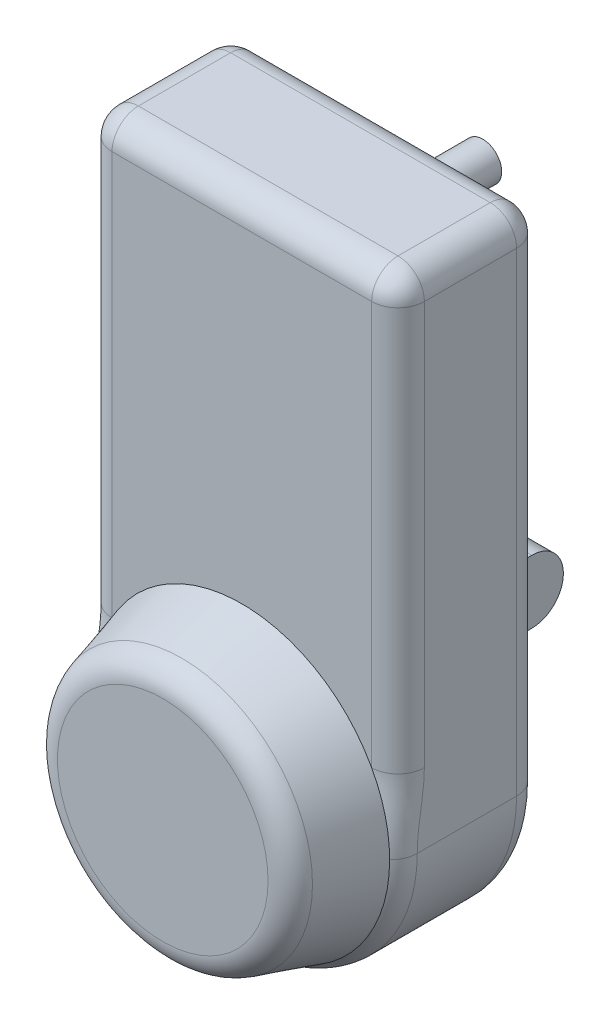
ISO-10303-21;
HEADER;
FILE_DESCRIPTION(('STEP AP214'),'2;1');
FILE_NAME('part.step','',(''),(''),'','','');
FILE_SCHEMA(('AUTOMOTIVE_DESIGN { 1 0 10303 214 1 1 1 1 }'));
ENDSEC;
DATA;
#1=APPLICATION_CONTEXT('core data for automotive mechanical design processes');
#2=APPLICATION_PROTOCOL_DEFINITION('international standard','automotive_design',2000,#1);
#3=PRODUCT_CONTEXT('',#1,'mechanical');
#4=PRODUCT('Part','Part','',(#3));
#5=PRODUCT_RELATED_PRODUCT_CATEGORY('part','',(#4));
#6=PRODUCT_DEFINITION_FORMATION('','',#4);
#7=PRODUCT_DEFINITION_CONTEXT('part definition',#1,'design');
#8=PRODUCT_DEFINITION('design','',#6,#7);
#9=PRODUCT_DEFINITION_SHAPE('','',#8);
#10=(LENGTH_UNIT() NAMED_UNIT(*) SI_UNIT(.MILLI.,.METRE.));
#11=(NAMED_UNIT(*) PLANE_ANGLE_UNIT() SI_UNIT($,.RADIAN.));
#12=(NAMED_UNIT(*) SI_UNIT($,.STERADIAN.) SOLID_ANGLE_UNIT());
#13=UNCERTAINTY_MEASURE_WITH_UNIT(LENGTH_MEASURE(1.E-05),#10,'distance_accuracy_value','');
#14=(GEOMETRIC_REPRESENTATION_CONTEXT(3) GLOBAL_UNCERTAINTY_ASSIGNED_CONTEXT((#13)) GLOBAL_UNIT_ASSIGNED_CONTEXT((#10,
#11,#12)) REPRESENTATION_CONTEXT('',''));
#15=CARTESIAN_POINT('',(0.,0.,0.));
#16=DIRECTION('',(0.,0.,1.));
#17=DIRECTION('',(1.,0.,0.));
#18=AXIS2_PLACEMENT_3D('',#15,#16,#17);
#19=CARTESIAN_POINT('',(0.,0.,0.));
#20=DIRECTION('',(0.,0.,1.));
#21=DIRECTION('',(1.,0.,0.));
#22=AXIS2_PLACEMENT_3D('',#19,#20,#21);
#23=PLANE('',#22);
#24=CARTESIAN_POINT('',(1.62968175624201,41.2166885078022,0.));
#25=DIRECTION('',(0.,0.,1.));
#26=DIRECTION('',(1.,0.,0.));
#27=AXIS2_PLACEMENT_3D('',#24,#25,#26);
#28=CIRCLE('',#27,1.82371156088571);
#29=CARTESIAN_POINT('',(3.45339331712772,41.2166885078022,0.));
#30=VERTEX_POINT('',#29);
#31=EDGE_CURVE('E11',#30,#30,#28,.F.);
#32=ORIENTED_EDGE('',*,*,#31,.F.);
#33=EDGE_LOOP('',(#32));
#34=FACE_BOUND('',#33,.T.);
#35=DIRECTION('',(-1.,0.,0.));
#36=VECTOR('',#35,1.);
#37=CARTESIAN_POINT('',(0.,45.72,0.));
#38=LINE('',#37,#36);
#39=CARTESIAN_POINT('',(-12.5095,45.72,0.));
#40=VERTEX_POINT('',#39);
#41=CARTESIAN_POINT('',(12.5095,45.72,0.));
#42=VERTEX_POINT('',#41);
#43=EDGE_CURVE('E53',#40,#42,#38,.F.);
#44=ORIENTED_EDGE('',*,*,#43,.T.);
#45=DIRECTION('',(0.,1.,0.));
#46=VECTOR('',#45,1.);
#47=CARTESIAN_POINT('',(12.5095,0.,0.));
#48=LINE('',#47,#46);
#49=CARTESIAN_POINT('',(12.5095,0.,0.));
#50=VERTEX_POINT('',#49);
#51=EDGE_CURVE('E38',#42,#50,#48,.F.);
#52=ORIENTED_EDGE('',*,*,#51,.T.);
#53=CARTESIAN_POINT('',(0.,0.,0.));
#54=DIRECTION('',(0.,0.,1.));
#55=DIRECTION('',(1.,0.,0.));
#56=AXIS2_PLACEMENT_3D('',#53,#54,#55);
#57=CIRCLE('',#56,12.5095);
#58=CARTESIAN_POINT('',(-12.5095,0.,0.));
#59=VERTEX_POINT('',#58);
#60=EDGE_CURVE('E436',#50,#59,#57,.F.);
#61=ORIENTED_EDGE('',*,*,#60,.T.);
#62=DIRECTION('',(0.,-1.,0.));
#63=VECTOR('',#62,1.);
#64=CARTESIAN_POINT('',(-12.5095,0.,0.));
#65=LINE('',#64,#63);
#66=EDGE_CURVE('E438',#59,#40,#65,.F.);
#67=ORIENTED_EDGE('',*,*,#66,.T.);
#68=EDGE_LOOP('',(#44,#52,#61,#67));
#69=FACE_BOUND('',#68,.T.);
#70=DIRECTION('',(0.,-1.,0.));
#71=VECTOR('',#70,1.);
#72=CARTESIAN_POINT('',(10.16,8.382,0.));
#73=LINE('',#72,#71);
#74=CARTESIAN_POINT('',(10.16,14.478,0.));
#75=VERTEX_POINT('',#74);
#76=CARTESIAN_POINT('',(10.16,8.382,0.));
#77=VERTEX_POINT('',#76);
#78=EDGE_CURVE('E175',#75,#77,#73,.T.);
#79=ORIENTED_EDGE('',*,*,#78,.F.);
#80=DIRECTION('',(-1.,0.,0.));
#81=VECTOR('',#80,1.);
#82=CARTESIAN_POINT('',(10.16,14.478,0.));
#83=LINE('',#82,#81);
#84=CARTESIAN_POINT('',(0.,14.478,0.));
#85=VERTEX_POINT('',#84);
#86=EDGE_CURVE('E178',#75,#85,#83,.T.);
#87=ORIENTED_EDGE('',*,*,#86,.T.);
#88=DIRECTION('',(0.,-1.,0.));
#89=VECTOR('',#88,1.);
#90=CARTESIAN_POINT('',(0.,8.382,0.));
#91=LINE('',#90,#89);
#92=CARTESIAN_POINT('',(0.,8.382,0.));
#93=VERTEX_POINT('',#92);
#94=EDGE_CURVE('E168',#85,#93,#91,.T.);
#95=ORIENTED_EDGE('',*,*,#94,.T.);
#96=DIRECTION('',(-1.,0.,0.));
#97=VECTOR('',#96,1.);
#98=CARTESIAN_POINT('',(10.16,8.382,0.));
#99=LINE('',#98,#97);
#100=EDGE_CURVE('E163',#77,#93,#99,.T.);
#101=ORIENTED_EDGE('',*,*,#100,.F.);
#102=EDGE_LOOP('',(#79,#87,#95,#101));
#103=FACE_BOUND('',#102,.T.);
#104=ADVANCED_FACE('F29',(#34,#69,#103),#23,.F.);
#105=CARTESIAN_POINT('',(0.,0.,13.97));
#106=DIRECTION('',(0.,0.,1.));
#107=DIRECTION('',(1.,0.,0.));
#108=AXIS2_PLACEMENT_3D('',#105,#106,#107);
#109=PLANE('',#108);
#110=CARTESIAN_POINT('',(0.,0.,13.97));
#111=DIRECTION('',(0.,0.,1.));
#112=DIRECTION('',(1.,0.,0.));
#113=AXIS2_PLACEMENT_3D('',#110,#111,#112);
#114=CIRCLE('',#113,14.2453327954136);
#115=CARTESIAN_POINT('',(12.5095,6.81483060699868,13.97));
#116=VERTEX_POINT('',#115);
#117=CARTESIAN_POINT('',(-12.5095,6.81483060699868,13.97));
#118=VERTEX_POINT('',#117);
#119=EDGE_CURVE('E476',#116,#118,#114,.T.);
#120=ORIENTED_EDGE('',*,*,#119,.F.);
#121=DIRECTION('',(0.,1.,0.));
#122=VECTOR('',#121,1.);
#123=CARTESIAN_POINT('',(12.5095,48.26,13.97));
#124=LINE('',#123,#122);
#125=CARTESIAN_POINT('',(12.5095,45.72,13.97));
#126=VERTEX_POINT('',#125);
#127=EDGE_CURVE('E389',#116,#126,#124,.T.);
#128=ORIENTED_EDGE('',*,*,#127,.T.);
#129=DIRECTION('',(-1.,0.,0.));
#130=VECTOR('',#129,1.);
#131=CARTESIAN_POINT('',(-15.0495,45.72,13.97));
#132=LINE('',#131,#130);
#133=CARTESIAN_POINT('',(-12.5095,45.72,13.97));
#134=VERTEX_POINT('',#133);
#135=EDGE_CURVE('E385',#126,#134,#132,.T.);
#136=ORIENTED_EDGE('',*,*,#135,.T.);
#137=DIRECTION('',(0.,-1.,0.));
#138=VECTOR('',#137,1.);
#139=CARTESIAN_POINT('',(-12.5095,0.,13.97));
#140=LINE('',#139,#138);
#141=EDGE_CURVE('E387',#134,#118,#140,.T.);
#142=ORIENTED_EDGE('',*,*,#141,.T.);
#143=EDGE_LOOP('',(#120,#128,#136,#142));
#144=FACE_BOUND('',#143,.T.);
#145=ADVANCED_FACE('F208',(#144),#109,.T.);
#146=CARTESIAN_POINT('',(0.,0.,13.97));
#147=DIRECTION('',(0.,0.,-1.));
#148=DIRECTION('',(-1.,0.,0.));
#149=AXIS2_PLACEMENT_3D('',#146,#147,#148);
#150=CYLINDRICAL_SURFACE('',#149,15.0495);
#151=DIRECTION('',(0.,0.,-1.));
#152=VECTOR('',#151,1.);
#153=CARTESIAN_POINT('',(15.0495,0.,13.97));
#154=LINE('',#153,#152);
#155=CARTESIAN_POINT('',(15.0495,0.,12.1156848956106));
#156=VERTEX_POINT('',#155);
#157=CARTESIAN_POINT('',(15.0495,0.,2.54));
#158=VERTEX_POINT('',#157);
#159=EDGE_CURVE('E368',#156,#158,#154,.T.);
#160=ORIENTED_EDGE('',*,*,#159,.F.);
#161=CARTESIAN_POINT('',(0.,0.,12.1156848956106));
#162=DIRECTION('',(0.,0.,1.));
#163=DIRECTION('',(1.,0.,0.));
#164=AXIS2_PLACEMENT_3D('',#161,#162,#163);
#165=CIRCLE('',#164,15.0495);
#166=CARTESIAN_POINT('',(-15.0495,0.,12.1156848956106));
#167=VERTEX_POINT('',#166);
#168=EDGE_CURVE('E355',#156,#167,#165,.F.);
#169=ORIENTED_EDGE('',*,*,#168,.T.);
#170=DIRECTION('',(0.,0.,-1.));
#171=VECTOR('',#170,1.);
#172=CARTESIAN_POINT('',(-15.0495,0.,13.97));
#173=LINE('',#172,#171);
#174=CARTESIAN_POINT('',(-15.0495,0.,2.54));
#175=VERTEX_POINT('',#174);
#176=EDGE_CURVE('E375',#167,#175,#173,.T.);
#177=ORIENTED_EDGE('',*,*,#176,.T.);
#178=CARTESIAN_POINT('',(0.,0.,2.54));
#179=DIRECTION('',(0.,0.,1.));
#180=DIRECTION('',(1.,0.,0.));
#181=AXIS2_PLACEMENT_3D('',#178,#179,#180);
#182=CIRCLE('',#181,15.0495);
#183=EDGE_CURVE('E363',#175,#158,#182,.T.);
#184=ORIENTED_EDGE('',*,*,#183,.T.);
#185=EDGE_LOOP('',(#160,#169,#177,#184));
#186=FACE_BOUND('',#185,.T.);
#187=ADVANCED_FACE('F303',(#186),#150,.T.);
#188=CARTESIAN_POINT('',(15.0495,0.,13.97));
#189=DIRECTION('',(-1.,0.,0.));
#190=DIRECTION('',(0.,0.,1.));
#191=AXIS2_PLACEMENT_3D('',#188,#189,#190);
#192=PLANE('',#191);
#193=DIRECTION('',(0.,1.,0.));
#194=VECTOR('',#193,1.);
#195=CARTESIAN_POINT('',(15.0495,0.,11.43));
#196=LINE('',#195,#194);
#197=CARTESIAN_POINT('',(15.0495,45.72,11.43));
#198=VERTEX_POINT('',#197);
#199=CARTESIAN_POINT('',(15.0495,6.81483060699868,11.43));
#200=VERTEX_POINT('',#199);
#201=EDGE_CURVE('E371',#198,#200,#196,.F.);
#202=ORIENTED_EDGE('',*,*,#201,.T.);
#203=CARTESIAN_POINT('',(15.0495,-1.50407576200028,12.0352771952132));
#204=CARTESIAN_POINT('',(15.0495,-1.62362806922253,13.212621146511));
#205=CARTESIAN_POINT('',(14.1434679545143,-1.70053540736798,13.97));
#206=CARTESIAN_POINT('',(15.0495,-1.36322886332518,12.0496054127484));
#207=CARTESIAN_POINT('',(15.0495,-1.47277249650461,13.2129147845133));
#208=CARTESIAN_POINT('',(14.1623521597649,-1.54356654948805,13.97));
#209=CARTESIAN_POINT('',(15.0495,-1.22220180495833,12.0622994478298));
#210=CARTESIAN_POINT('',(15.0495,-1.3209201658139,13.2134506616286));
#211=CARTESIAN_POINT('',(14.1787023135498,-1.38544232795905,13.97));
#212=CARTESIAN_POINT('',(15.0495,-0.939839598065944,12.0839338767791));
#213=CARTESIAN_POINT('',(15.0495,-1.01656522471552,13.2146436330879));
#214=CARTESIAN_POINT('',(14.2061752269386,-1.06746468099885,13.97));
#215=CARTESIAN_POINT('',(15.0495,-0.798504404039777,12.0928736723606));
#216=CARTESIAN_POINT('',(15.0495,-0.86387401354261,13.2153011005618));
#217=CARTESIAN_POINT('',(14.217297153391,-0.907610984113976,13.97));
#218=CARTESIAN_POINT('',(15.0495,-0.515941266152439,12.1064941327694));
#219=CARTESIAN_POINT('',(15.0495,-0.558491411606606,13.2163799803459));
#220=CARTESIAN_POINT('',(14.2341292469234,-0.587167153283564,13.97));
#221=CARTESIAN_POINT('',(15.0495,-0.374713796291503,12.1111843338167));
#222=CARTESIAN_POINT('',(15.0495,-0.405609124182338,13.2168030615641));
#223=CARTESIAN_POINT('',(14.2398515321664,-0.426579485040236,13.97));
#224=CARTESIAN_POINT('',(15.0495,-0.0921941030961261,12.1161122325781));
#225=CARTESIAN_POINT('',(15.0495,-0.0998602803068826,13.2172539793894));
#226=CARTESIAN_POINT('',(14.2458540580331,-0.105024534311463,13.97));
#227=CARTESIAN_POINT('',(15.0495,0.0490981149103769,12.1163502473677));
#228=CARTESIAN_POINT('',(15.0495,0.0532009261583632,13.2172824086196));
#229=CARTESIAN_POINT('',(14.2461346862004,0.0559427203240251,13.97));
#230=CARTESIAN_POINT('',(15.0495,0.472910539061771,12.1102897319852));
#231=CARTESIAN_POINT('',(15.0495,0.512017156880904,13.2167071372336));
#232=CARTESIAN_POINT('',(14.2387813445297,0.538393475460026,13.97));
#233=CARTESIAN_POINT('',(15.0495,0.755354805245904,12.0972160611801));
#234=CARTESIAN_POINT('',(15.0495,0.81830175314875,13.2154393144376));
#235=CARTESIAN_POINT('',(14.2229514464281,0.859412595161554,13.97));
#236=CARTESIAN_POINT('',(15.0495,1.31927561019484,12.055597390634));
#237=CARTESIAN_POINT('',(15.0495,1.42634911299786,13.213025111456));
#238=CARTESIAN_POINT('',(14.1702642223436,1.49501519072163,13.97));
#239=CARTESIAN_POINT('',(15.0495,1.60075096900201,12.0270376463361));
#240=CARTESIAN_POINT('',(15.0495,1.72961496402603,13.211873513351));
#241=CARTESIAN_POINT('',(14.133386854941,1.80959223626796,13.97));
#242=CARTESIAN_POINT('',(15.0495,2.1598426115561,11.9599434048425));
#243=CARTESIAN_POINT('',(15.0495,2.32688719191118,13.2136005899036));
#244=CARTESIAN_POINT('',(14.0407876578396,2.42525410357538,13.97));
#245=CARTESIAN_POINT('',(15.0495,2.43747068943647,11.9215021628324));
#246=CARTESIAN_POINT('',(15.0495,2.62235478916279,13.2164920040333));
#247=CARTESIAN_POINT('',(13.9852405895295,2.72643574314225,13.97));
#248=CARTESIAN_POINT('',(15.0495,2.99207126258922,11.8401743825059));
#249=CARTESIAN_POINT('',(15.0495,3.20575921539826,13.2309089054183));
#250=CARTESIAN_POINT('',(13.8573274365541,3.31586775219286,13.97));
#251=CARTESIAN_POINT('',(15.0495,3.26904369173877,11.7972874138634));
#252=CARTESIAN_POINT('',(15.0495,3.49494828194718,13.2426114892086));
#253=CARTESIAN_POINT('',(13.7849597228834,3.60411686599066,13.97));
#254=CARTESIAN_POINT('',(15.0495,3.82246823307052,11.7125948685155));
#255=CARTESIAN_POINT('',(15.0495,4.06354779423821,13.2796454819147));
#256=CARTESIAN_POINT('',(13.6258677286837,4.16534673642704,13.97));
#257=CARTESIAN_POINT('',(15.0495,4.09891996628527,11.6707869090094));
#258=CARTESIAN_POINT('',(15.0495,4.34412136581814,13.3053270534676));
#259=CARTESIAN_POINT('',(13.5391789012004,4.4383630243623,13.97));
#260=CARTESIAN_POINT('',(15.0495,4.65278758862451,11.593145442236));
#261=CARTESIAN_POINT('',(15.0495,4.89375771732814,13.3755730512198));
#262=CARTESIAN_POINT('',(13.3536299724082,4.96880746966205,13.97));
#263=CARTESIAN_POINT('',(15.0495,4.93020375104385,11.5573137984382));
#264=CARTESIAN_POINT('',(15.0495,5.16378421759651,13.4208259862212));
#265=CARTESIAN_POINT('',(13.2547660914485,5.22623074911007,13.97));
#266=CARTESIAN_POINT('',(15.0495,5.48939021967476,11.4961737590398));
#267=CARTESIAN_POINT('',(15.0495,5.69075515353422,13.5364310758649));
#268=CARTESIAN_POINT('',(13.0461716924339,5.72724846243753,13.97));
#269=CARTESIAN_POINT('',(15.0495,5.77117449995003,11.4709876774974));
#270=CARTESIAN_POINT('',(15.0495,5.94815629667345,13.6081693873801));
#271=CARTESIAN_POINT('',(12.9363319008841,5.97065579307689,13.97));
#272=CARTESIAN_POINT('',(15.0495,6.33552718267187,11.4369688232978));
#273=CARTESIAN_POINT('',(15.0495,6.43829697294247,13.782575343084));
#274=CARTESIAN_POINT('',(12.709509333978,6.43937455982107,13.97));
#275=CARTESIAN_POINT('',(15.0495,6.61809417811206,11.4281157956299));
#276=CARTESIAN_POINT('',(15.0495,6.67132597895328,13.8869381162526));
#277=CARTESIAN_POINT('',(12.5925355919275,6.66470807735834,13.97));
#278=CARTESIAN_POINT('',(15.0495,7.04392865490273,11.4314603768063));
#279=CARTESIAN_POINT('',(15.0495,6.99032097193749,14.0695398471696));
#280=CARTESIAN_POINT('',(12.4129548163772,6.99026107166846,13.97));
#281=CARTESIAN_POINT('',(15.0495,7.18726322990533,11.4354379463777));
#282=CARTESIAN_POINT('',(15.0495,7.09395213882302,14.136880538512));
#283=CARTESIAN_POINT('',(12.3519446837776,7.09744349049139,13.97));
#284=CARTESIAN_POINT('',(15.0495,7.47357285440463,11.449970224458));
#285=CARTESIAN_POINT('',(15.0495,7.2887076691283,14.2817433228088));
#286=CARTESIAN_POINT('',(12.2292408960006,7.30683855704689,13.97));
#287=CARTESIAN_POINT('',(15.0495,7.61654799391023,11.4605230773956));
#288=CARTESIAN_POINT('',(15.0495,7.3796325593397,14.3596404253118));
#289=CARTESIAN_POINT('',(12.1675474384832,7.40905259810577,13.97));
#290=CARTESIAN_POINT('',(15.0495,7.90242917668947,11.4892133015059));
#291=CARTESIAN_POINT('',(15.0495,7.545921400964,14.5263880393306));
#292=CARTESIAN_POINT('',(12.0436262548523,7.60883987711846,13.97));
#293=CARTESIAN_POINT('',(15.0495,8.04533186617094,11.5073853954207));
#294=CARTESIAN_POINT('',(15.0495,7.62083809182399,14.6157137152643));
#295=CARTESIAN_POINT('',(11.9813973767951,7.70638956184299,13.97));
#296=CARTESIAN_POINT('',(15.0495,8.32989413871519,11.5524498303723));
#297=CARTESIAN_POINT('',(15.0495,7.74994681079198,14.8045866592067));
#298=CARTESIAN_POINT('',(11.8571554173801,7.89622004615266,13.97));
#299=CARTESIAN_POINT('',(15.0495,8.47155228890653,11.5793511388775));
#300=CARTESIAN_POINT('',(15.0495,7.80352137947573,14.90460979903));
#301=CARTESIAN_POINT('',(11.7951426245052,7.98849531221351,13.97));
#302=CARTESIAN_POINT('',(15.0495,8.61218478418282,11.6111661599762));
#303=CARTESIAN_POINT('',(15.0495,7.84298223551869,15.0076024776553));
#304=CARTESIAN_POINT('',(11.7335365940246,8.07797161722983,13.97));
#305=(BOUNDED_SURFACE() B_SPLINE_SURFACE(3,2,((#203,#204,#205),(#206,#207,#208),(#209,#210,
#211),(#212,#213,#214),(#215,#216,#217),(#218,#219,#220),(#221,#222,#223),(#224,#225,#226),
(#227,#228,#229),(#230,#231,#232),(#233,#234,#235),(#236,#237,#238),(#239,#240,#241),(#242,#243,
#244),(#245,#246,#247),(#248,#249,#250),(#251,#252,#253),(#254,#255,#256),(#257,#258,#259),
(#260,#261,#262),(#263,#264,#265),(#266,#267,#268),(#269,#270,#271),(#272,#273,#274),(#275,#276,
#277),(#278,#279,#280),(#281,#282,#283),(#284,#285,#286),(#287,#288,#289),(#290,#291,#292),
(#293,#294,#295),(#296,#297,#298),(#299,#300,#301),(#302,#303,#304)),.UNSPECIFIED.,.F.,.F.,
.F.) B_SPLINE_SURFACE_WITH_KNOTS((4,2,2,2,2,2,2,2,2,2,2,2,2,2,2,2,4),(3,3),(0.,
0.424732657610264,0.849532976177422,1.2733776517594,1.69719214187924,2.54485622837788,
3.39332881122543,4.23407059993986,5.07489384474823,5.91366592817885,6.75269906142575,
7.60112632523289,8.44850072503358,8.87854612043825,9.3084702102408,9.74037523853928,
10.1727253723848),(0.,1.),
.UNSPECIFIED.) GEOMETRIC_REPRESENTATION_ITEM() RATIONAL_B_SPLINE_SURFACE(((1.,0.906447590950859,
1.),(1.,0.908497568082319,1.),(1.,0.910266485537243,1.),(1.,0.913232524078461,1.),(1.,
0.914429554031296,1.),(1.,0.916239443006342,1.),(1.,0.916853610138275,1.),(1.,0.917497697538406,
1.),(1.,0.91752765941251,1.),(1.,0.916739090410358,1.),(1.,0.915042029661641,1.),(1.,
0.909356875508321,1.),(1.,0.905366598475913,1.),(1.,0.895242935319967,1.),(1.,0.889129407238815,
1.),(1.,0.874854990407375,1.),(1.,0.866693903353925,1.),(1.,0.848434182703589,1.),(1.,
0.838340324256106,1.),(1.,0.816265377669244,1.),(1.,0.804283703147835,1.),(1.,0.778340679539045,
1.),(1.,0.764358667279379,1.),(1.,0.734570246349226,1.),(1.,0.718766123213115,1.),(1.,
0.693589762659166,1.),(1.,0.684883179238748,1.),(1.,0.667016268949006,1.),(1.,0.657856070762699,
1.),(1.,0.639047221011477,1.),(1.,0.629396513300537,1.),(1.,0.609658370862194,1.),(1.,
0.599570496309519,1.),(1.,0.589280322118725,1.))) REPRESENTATION_ITEM('') SURFACE());
#306=CARTESIAN_POINT('',(15.0495,8.61218478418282,11.6111661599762));
#307=CARTESIAN_POINT('',(15.0495,8.47155228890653,11.5793511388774));
#308=CARTESIAN_POINT('',(15.0495,8.32989413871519,11.5524498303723));
#309=CARTESIAN_POINT('',(15.0495,8.04533186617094,11.5073853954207));
#310=CARTESIAN_POINT('',(15.0495,7.90242917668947,11.4892133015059));
#311=CARTESIAN_POINT('',(15.0495,7.61654799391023,11.4605230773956));
#312=CARTESIAN_POINT('',(15.0495,7.47357285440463,11.449970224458));
#313=CARTESIAN_POINT('',(15.0495,7.18726322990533,11.4354379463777));
#314=CARTESIAN_POINT('',(15.0495,7.04392865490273,11.4314603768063));
#315=CARTESIAN_POINT('',(15.0495,6.61809417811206,11.4281157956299));
#316=CARTESIAN_POINT('',(15.0495,6.33552718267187,11.4369688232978));
#317=CARTESIAN_POINT('',(15.0495,5.77117449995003,11.4709876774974));
#318=CARTESIAN_POINT('',(15.0495,5.48939021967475,11.4961737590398));
#319=CARTESIAN_POINT('',(15.0495,4.93020375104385,11.5573137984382));
#320=CARTESIAN_POINT('',(15.0495,4.65278758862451,11.593145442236));
#321=CARTESIAN_POINT('',(15.0495,4.09891996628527,11.6707869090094));
#322=CARTESIAN_POINT('',(15.0495,3.82246823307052,11.7125948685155));
#323=CARTESIAN_POINT('',(15.0495,3.26904369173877,11.7972874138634));
#324=CARTESIAN_POINT('',(15.0495,2.99207126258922,11.8401743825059));
#325=CARTESIAN_POINT('',(15.0495,2.43747068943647,11.9215021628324));
#326=CARTESIAN_POINT('',(15.0495,2.1598426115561,11.9599434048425));
#327=CARTESIAN_POINT('',(15.0495,1.60075096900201,12.0270376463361));
#328=CARTESIAN_POINT('',(15.0495,1.31927561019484,12.055597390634));
#329=CARTESIAN_POINT('',(15.0495,0.755354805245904,12.0972160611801));
#330=CARTESIAN_POINT('',(15.0495,0.472910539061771,12.1102897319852));
#331=CARTESIAN_POINT('',(15.0495,0.0490981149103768,12.1163502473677));
#332=CARTESIAN_POINT('',(15.0495,-0.0921941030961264,12.1161122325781));
#333=CARTESIAN_POINT('',(15.0495,-0.374713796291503,12.1111843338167));
#334=CARTESIAN_POINT('',(15.0495,-0.515941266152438,12.1064941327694));
#335=CARTESIAN_POINT('',(15.0495,-0.798504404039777,12.0928736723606));
#336=CARTESIAN_POINT('',(15.0495,-0.939839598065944,12.0839338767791));
#337=CARTESIAN_POINT('',(15.0495,-1.22220180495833,12.0622994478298));
#338=CARTESIAN_POINT('',(15.0495,-1.36322886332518,12.0496054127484));
#339=CARTESIAN_POINT('',(15.0495,-1.50407576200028,12.0352771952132));
#340=B_SPLINE_CURVE_WITH_KNOTS('',3,(#306,#307,#308,#309,#310,#311,#312,#313,#314,#315,#316,
#317,#318,#319,#320,#321,#322,#323,#324,#325,#326,#327,#328,#329,#330,#331,#332,#333,#334,#335,
#336,#337,#338,#339),.UNSPECIFIED.,.F.,.F.,(4,2,2,2,2,2,2,2,2,2,2,2,2,2,2,2,4),(0.,
0.432350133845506,0.864255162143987,1.29417925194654,1.72422464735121,2.5715990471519,
3.42002631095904,4.25905944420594,5.09783152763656,5.93865477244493,6.77939656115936,
7.62786914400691,8.47553323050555,8.89934772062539,9.32319239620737,9.74799271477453,
10.1727253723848),.UNSPECIFIED.);
#341=EDGE_CURVE('E348',#200,#156,#340,.T.);
#342=ORIENTED_EDGE('',*,*,#341,.T.);
#343=ORIENTED_EDGE('',*,*,#159,.T.);
#344=DIRECTION('',(0.,1.,0.));
#345=VECTOR('',#344,1.);
#346=CARTESIAN_POINT('',(15.0495,0.,2.54));
#347=LINE('',#346,#345);
#348=CARTESIAN_POINT('',(15.0495,45.72,2.54));
#349=VERTEX_POINT('',#348);
#350=EDGE_CURVE('E391',#158,#349,#347,.T.);
#351=ORIENTED_EDGE('',*,*,#350,.T.);
#352=DIRECTION('',(0.,0.,-1.));
#353=VECTOR('',#352,1.);
#354=CARTESIAN_POINT('',(15.0495,45.72,13.97));
#355=LINE('',#354,#353);
#356=EDGE_CURVE('E393',#349,#198,#355,.F.);
#357=ORIENTED_EDGE('',*,*,#356,.T.);
#358=EDGE_LOOP('',(#202,#342,#343,#351,#357));
#359=FACE_BOUND('',#358,.T.);
#360=ADVANCED_FACE('F367',(#359),#192,.F.);
#361=CARTESIAN_POINT('',(-15.0495,48.26,13.97));
#362=DIRECTION('',(0.,-1.,0.));
#363=DIRECTION('',(0.,0.,-1.));
#364=AXIS2_PLACEMENT_3D('',#361,#362,#363);
#365=PLANE('',#364);
#366=DIRECTION('',(-1.,0.,0.));
#367=VECTOR('',#366,1.);
#368=CARTESIAN_POINT('',(15.0495,48.26,11.43));
#369=LINE('',#368,#367);
#370=CARTESIAN_POINT('',(-12.5095,48.26,11.43));
#371=VERTEX_POINT('',#370);
#372=CARTESIAN_POINT('',(12.5095,48.26,11.43));
#373=VERTEX_POINT('',#372);
#374=EDGE_CURVE('E431',#371,#373,#369,.F.);
#375=ORIENTED_EDGE('',*,*,#374,.T.);
#376=DIRECTION('',(0.,0.,-1.));
#377=VECTOR('',#376,1.);
#378=CARTESIAN_POINT('',(12.5095,48.26,13.97));
#379=LINE('',#378,#377);
#380=CARTESIAN_POINT('',(12.5095,48.26,2.54));
#381=VERTEX_POINT('',#380);
#382=EDGE_CURVE('E433',#373,#381,#379,.T.);
#383=ORIENTED_EDGE('',*,*,#382,.T.);
#384=DIRECTION('',(-1.,0.,0.));
#385=VECTOR('',#384,1.);
#386=CARTESIAN_POINT('',(-15.0495,48.26,2.54));
#387=LINE('',#386,#385);
#388=CARTESIAN_POINT('',(-12.5095,48.26,2.54));
#389=VERTEX_POINT('',#388);
#390=EDGE_CURVE('E425',#381,#389,#387,.T.);
#391=ORIENTED_EDGE('',*,*,#390,.T.);
#392=DIRECTION('',(0.,0.,-1.));
#393=VECTOR('',#392,1.);
#394=CARTESIAN_POINT('',(-12.5095,48.26,13.97));
#395=LINE('',#394,#393);
#396=EDGE_CURVE('E429',#389,#371,#395,.F.);
#397=ORIENTED_EDGE('',*,*,#396,.T.);
#398=EDGE_LOOP('',(#375,#383,#391,#397));
#399=FACE_BOUND('',#398,.T.);
#400=ADVANCED_FACE('F407',(#399),#365,.F.);
#401=CARTESIAN_POINT('',(-15.0495,0.,13.97));
#402=DIRECTION('',(1.,0.,0.));
#403=DIRECTION('',(0.,0.,-1.));
#404=AXIS2_PLACEMENT_3D('',#401,#402,#403);
#405=PLANE('',#404);
#406=ORIENTED_EDGE('',*,*,#176,.F.);
#407=CARTESIAN_POINT('',(-14.1434679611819,-1.70053535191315,13.97));
#408=CARTESIAN_POINT('',(-15.0495,-1.62362803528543,13.2126211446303));
#409=CARTESIAN_POINT('',(-15.0495,-1.50407576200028,12.0352771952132));
#410=CARTESIAN_POINT('',(-14.1623521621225,-1.54356652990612,13.97));
#411=CARTESIAN_POINT('',(-15.0495,-1.47277248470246,13.212914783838));
#412=CARTESIAN_POINT('',(-15.0495,-1.36322886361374,12.0496054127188));
#413=CARTESIAN_POINT('',(-14.1787023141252,-1.38544232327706,13.97));
#414=CARTESIAN_POINT('',(-15.0495,-1.32092016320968,13.2134506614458));
#415=CARTESIAN_POINT('',(-15.0495,-1.22220180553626,12.0622994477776));
#416=CARTESIAN_POINT('',(-14.2061752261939,-1.06746468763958,13.97));
#417=CARTESIAN_POINT('',(-15.0495,-1.01656522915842,13.2146436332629));
#418=CARTESIAN_POINT('',(-15.0495,-0.939839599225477,12.083933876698));
#419=CARTESIAN_POINT('',(-14.2172971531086,-0.907610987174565,13.97));
#420=CARTESIAN_POINT('',(-15.0495,-0.86387401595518,13.2153011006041));
#421=CARTESIAN_POINT('',(-15.0495,-0.798504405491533,12.0928736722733));
#422=CARTESIAN_POINT('',(-14.2341292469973,-0.587167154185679,13.97));
#423=CARTESIAN_POINT('',(-15.0495,-0.558491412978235,13.2163799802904));
#424=CARTESIAN_POINT('',(-15.0495,-0.515941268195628,12.1064941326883));
#425=CARTESIAN_POINT('',(-14.2398515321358,-0.426579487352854,13.97));
#426=CARTESIAN_POINT('',(-15.0495,-0.405609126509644,13.216803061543));
#427=CARTESIAN_POINT('',(-15.0495,-0.374713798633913,12.1111843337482));
#428=CARTESIAN_POINT('',(-14.2458540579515,-0.105024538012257,13.97));
#429=CARTESIAN_POINT('',(-15.0495,-0.0998602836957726,13.2172539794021));
#430=CARTESIAN_POINT('',(-15.0495,-0.0921941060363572,12.1161122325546));
#431=CARTESIAN_POINT('',(-14.2461346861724,0.0559427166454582,13.97));
#432=CARTESIAN_POINT('',(-15.0495,0.053200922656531,13.2172824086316));
#433=CARTESIAN_POINT('',(-15.0495,0.0490981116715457,12.1163502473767));
#434=CARTESIAN_POINT('',(-14.2387813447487,0.538393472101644,13.97));
#435=CARTESIAN_POINT('',(-15.0495,0.512017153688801,13.2167071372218));
#436=CARTESIAN_POINT('',(-15.0495,0.472910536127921,12.1102897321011));
#437=CARTESIAN_POINT('',(-14.2229514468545,0.859412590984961,13.97));
#438=CARTESIAN_POINT('',(-15.0495,0.81830174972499,13.2154393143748));
#439=CARTESIAN_POINT('',(-15.0495,0.75535480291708,12.0972160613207));
#440=CARTESIAN_POINT('',(-14.1702642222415,1.49501519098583,13.97));
#441=CARTESIAN_POINT('',(-15.0495,1.42634911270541,13.2130251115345));
#442=CARTESIAN_POINT('',(-15.0495,1.31927560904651,12.0555973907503));
#443=CARTESIAN_POINT('',(-14.1333868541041,1.8095922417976,13.97));
#444=CARTESIAN_POINT('',(-15.0495,1.7296149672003,13.2118735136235));
#445=CARTESIAN_POINT('',(-15.0495,1.60075096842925,12.0270376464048));
#446=CARTESIAN_POINT('',(-14.0407876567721,2.42525411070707,13.97));
#447=CARTESIAN_POINT('',(-15.0495,2.32688719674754,13.2136005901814));
#448=CARTESIAN_POINT('',(-15.0495,2.15984261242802,11.959943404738));
#449=CARTESIAN_POINT('',(-13.985240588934,2.72643574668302,13.97));
#450=CARTESIAN_POINT('',(-15.0495,2.62235479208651,13.216492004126));
#451=CARTESIAN_POINT('',(-15.0495,2.43747069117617,11.9215021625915));
#452=CARTESIAN_POINT('',(-13.8573274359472,3.31586775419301,13.97));
#453=CARTESIAN_POINT('',(-15.0495,3.20575921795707,13.2309089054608));
#454=CARTESIAN_POINT('',(-15.0495,2.99207126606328,11.8401743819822));
#455=CARTESIAN_POINT('',(-13.7849597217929,3.60411687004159,13.97));
#456=CARTESIAN_POINT('',(-15.0495,3.4949482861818,13.2426114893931));
#457=CARTESIAN_POINT('',(-15.0495,3.26904369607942,11.7972874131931));
#458=CARTESIAN_POINT('',(-13.6258677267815,4.16534674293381,13.97));
#459=CARTESIAN_POINT('',(-15.0495,4.06354780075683,13.2796454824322));
#460=CARTESIAN_POINT('',(-15.0495,3.82246823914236,11.7125948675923));
#461=CARTESIAN_POINT('',(-13.5391788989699,4.43836303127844,13.97));
#462=CARTESIAN_POINT('',(-15.0495,4.34412137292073,13.3053270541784));
#463=CARTESIAN_POINT('',(-15.0495,4.09891997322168,11.6707869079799));
#464=CARTESIAN_POINT('',(-13.3536299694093,4.96880747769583,13.97));
#465=CARTESIAN_POINT('',(-15.0495,4.89375772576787,13.3755730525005));
#466=CARTESIAN_POINT('',(-15.0495,4.65278759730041,11.5931454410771));
#467=CARTESIAN_POINT('',(-13.2547660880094,5.22623075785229,13.97));
#468=CARTESIAN_POINT('',(-15.0495,5.1637842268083,13.4208259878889));
#469=CARTESIAN_POINT('',(-15.0495,4.93020376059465,11.5573137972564));
#470=CARTESIAN_POINT('',(-13.0461716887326,5.72724847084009,13.97));
#471=CARTESIAN_POINT('',(-15.0495,5.69075516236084,13.5364310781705));
#472=CARTESIAN_POINT('',(-15.0495,5.48939022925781,11.4961737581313));
#473=CARTESIAN_POINT('',(-12.9363318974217,5.97065580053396,13.97));
#474=CARTESIAN_POINT('',(-15.0495,5.94815630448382,13.6081693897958));
#475=CARTESIAN_POINT('',(-15.0495,5.7711745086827,11.4709876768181));
#476=CARTESIAN_POINT('',(-12.7095093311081,6.43937456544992,13.97));
#477=CARTESIAN_POINT('',(-15.0495,6.43829697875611,13.7825753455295));
#478=CARTESIAN_POINT('',(-15.0495,6.3355271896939,11.4369688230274));
#479=CARTESIAN_POINT('',(-12.5925355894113,6.66470808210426,13.97));
#480=CARTESIAN_POINT('',(-15.0495,6.67132598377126,13.8869381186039));
#481=CARTESIAN_POINT('',(-15.0495,6.61809418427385,11.4281157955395));
#482=CARTESIAN_POINT('',(-12.4129548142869,6.99026107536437,13.97));
#483=CARTESIAN_POINT('',(-15.0495,6.99032097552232,14.069539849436));
#484=CARTESIAN_POINT('',(-15.0495,7.04392865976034,11.4314603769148));
#485=CARTESIAN_POINT('',(-12.3519446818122,7.09744349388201,13.97));
#486=CARTESIAN_POINT('',(-15.0495,7.09395214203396,14.1368805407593));
#487=CARTESIAN_POINT('',(-15.0495,7.18726323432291,11.4354379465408));
#488=CARTESIAN_POINT('',(-12.2292408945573,7.3068385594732,13.97));
#489=CARTESIAN_POINT('',(-15.0495,7.28870767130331,14.2817433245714));
#490=CARTESIAN_POINT('',(-15.0495,7.47357285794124,11.4499702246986));
#491=CARTESIAN_POINT('',(-12.167547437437,7.40905259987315,13.97));
#492=CARTESIAN_POINT('',(-15.0495,7.37963256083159,14.3596404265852));
#493=CARTESIAN_POINT('',(-15.0495,7.61654799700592,11.4605230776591));
#494=CARTESIAN_POINT('',(-12.0436262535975,7.60883987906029,13.97));
#495=CARTESIAN_POINT('',(-15.0495,7.5459214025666,14.5263880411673));
#496=CARTESIAN_POINT('',(-15.0495,7.90242917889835,11.489213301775));
#497=CARTESIAN_POINT('',(-11.9813973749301,7.70638956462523,13.97));
#498=CARTESIAN_POINT('',(-15.0495,7.62083809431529,14.6157137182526));
#499=CARTESIAN_POINT('',(-15.0495,8.04533186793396,11.5073853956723));
#500=CARTESIAN_POINT('',(-11.8571554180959,7.89622004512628,13.97));
#501=CARTESIAN_POINT('',(-15.0495,7.74994680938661,14.8045866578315));
#502=CARTESIAN_POINT('',(-15.0495,8.32989413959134,11.5524498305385));
#503=CARTESIAN_POINT('',(-11.7951426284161,7.98849530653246,13.97));
#504=CARTESIAN_POINT('',(-15.0495,7.80352137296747,14.9046097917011));
#505=CARTESIAN_POINT('',(-15.0495,8.47155228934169,11.5793511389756));
#506=CARTESIAN_POINT('',(-11.7335366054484,8.07797160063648,13.97));
#507=CARTESIAN_POINT('',(-15.0495,7.84298221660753,15.0076024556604));
#508=CARTESIAN_POINT('',(-15.0495,8.61218478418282,11.6111661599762));
#509=(BOUNDED_SURFACE() B_SPLINE_SURFACE(3,2,((#407,#408,#409),(#410,#411,#412),(#413,#414,
#415),(#416,#417,#418),(#419,#420,#421),(#422,#423,#424),(#425,#426,#427),(#428,#429,#430),
(#431,#432,#433),(#434,#435,#436),(#437,#438,#439),(#440,#441,#442),(#443,#444,#445),(#446,#447,
#448),(#449,#450,#451),(#452,#453,#454),(#455,#456,#457),(#458,#459,#460),(#461,#462,#463),
(#464,#465,#466),(#467,#468,#469),(#470,#471,#472),(#473,#474,#475),(#476,#477,#478),(#479,#480,
#481),(#482,#483,#484),(#485,#486,#487),(#488,#489,#490),(#491,#492,#493),(#494,#495,#496),
(#497,#498,#499),(#500,#501,#502),(#503,#504,#505),(#506,#507,#508)),.UNSPECIFIED.,.F.,.F.,
.F.) B_SPLINE_SURFACE_WITH_KNOTS((4,2,2,2,2,2,2,2,2,2,2,2,2,2,2,2,4),(3,3),(0.,
0.424732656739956,0.84953297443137,1.27337764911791,1.69719213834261,2.54485622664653,
3.39332881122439,4.234070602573,5.07489385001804,5.91366593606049,6.75269907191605,
7.601126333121,8.4485007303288,8.8785461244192,9.30847021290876,9.7403752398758,
10.1727253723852),(0.,1.),
.UNSPECIFIED.) GEOMETRIC_REPRESENTATION_ITEM() RATIONAL_B_SPLINE_SURFACE(((1.,0.90644759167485,
1.),(1.,0.908497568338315,1.),(1.,0.910266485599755,1.),(1.,0.913232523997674,1.),(1.,
0.914429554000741,1.),(1.,0.916239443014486,1.),(1.,0.916853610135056,1.),(1.,0.917497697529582,
1.),(1.,0.917527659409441,1.),(1.,0.916739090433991,1.),(1.,0.915042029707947,1.),(1.,
0.909356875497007,1.),(1.,0.905366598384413,1.),(1.,0.895242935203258,1.),(1.,0.889129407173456,
1.),(1.,0.874854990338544,1.),(1.,0.866693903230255,1.),(1.,0.848434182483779,1.),(1.,
0.838340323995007,1.),(1.,0.816265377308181,1.),(1.,0.804283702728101,1.),(1.,0.778340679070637,
1.),(1.,0.764358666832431,1.),(1.,0.734570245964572,1.),(1.,0.718766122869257,1.),(1.,
0.693589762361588,1.),(1.,0.684883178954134,1.),(1.,0.667016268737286,1.),(1.,0.657856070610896,
1.),(1.,0.639047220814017,1.),(1.,0.629396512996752,1.),(1.,0.609658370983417,1.),(1.,
0.599570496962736,1.),(1.,0.589280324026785,1.))) REPRESENTATION_ITEM('') SURFACE());
#510=CARTESIAN_POINT('',(-15.0495,-1.50407576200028,12.0352771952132));
#511=CARTESIAN_POINT('',(-15.0495,-1.36322886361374,12.0496054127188));
#512=CARTESIAN_POINT('',(-15.0495,-1.22220180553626,12.0622994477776));
#513=CARTESIAN_POINT('',(-15.0495,-0.939839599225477,12.083933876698));
#514=CARTESIAN_POINT('',(-15.0495,-0.798504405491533,12.0928736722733));
#515=CARTESIAN_POINT('',(-15.0495,-0.515941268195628,12.1064941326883));
#516=CARTESIAN_POINT('',(-15.0495,-0.374713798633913,12.1111843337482));
#517=CARTESIAN_POINT('',(-15.0495,-0.0921941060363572,12.1161122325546));
#518=CARTESIAN_POINT('',(-15.0495,0.0490981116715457,12.1163502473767));
#519=CARTESIAN_POINT('',(-15.0495,0.472910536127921,12.1102897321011));
#520=CARTESIAN_POINT('',(-15.0495,0.75535480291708,12.0972160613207));
#521=CARTESIAN_POINT('',(-15.0495,1.31927560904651,12.0555973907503));
#522=CARTESIAN_POINT('',(-15.0495,1.60075096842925,12.0270376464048));
#523=CARTESIAN_POINT('',(-15.0495,2.15984261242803,11.959943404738));
#524=CARTESIAN_POINT('',(-15.0495,2.43747069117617,11.9215021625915));
#525=CARTESIAN_POINT('',(-15.0495,2.99207126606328,11.8401743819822));
#526=CARTESIAN_POINT('',(-15.0495,3.26904369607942,11.7972874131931));
#527=CARTESIAN_POINT('',(-15.0495,3.82246823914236,11.7125948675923));
#528=CARTESIAN_POINT('',(-15.0495,4.09891997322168,11.6707869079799));
#529=CARTESIAN_POINT('',(-15.0495,4.65278759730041,11.5931454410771));
#530=CARTESIAN_POINT('',(-15.0495,4.93020376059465,11.5573137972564));
#531=CARTESIAN_POINT('',(-15.0495,5.48939022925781,11.4961737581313));
#532=CARTESIAN_POINT('',(-15.0495,5.7711745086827,11.4709876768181));
#533=CARTESIAN_POINT('',(-15.0495,6.3355271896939,11.4369688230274));
#534=CARTESIAN_POINT('',(-15.0495,6.61809418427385,11.4281157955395));
#535=CARTESIAN_POINT('',(-15.0495,7.04392865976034,11.4314603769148));
#536=CARTESIAN_POINT('',(-15.0495,7.18726323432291,11.4354379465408));
#537=CARTESIAN_POINT('',(-15.0495,7.47357285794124,11.4499702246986));
#538=CARTESIAN_POINT('',(-15.0495,7.61654799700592,11.4605230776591));
#539=CARTESIAN_POINT('',(-15.0495,7.90242917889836,11.489213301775));
#540=CARTESIAN_POINT('',(-15.0495,8.04533186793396,11.5073853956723));
#541=CARTESIAN_POINT('',(-15.0495,8.32989413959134,11.5524498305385));
#542=CARTESIAN_POINT('',(-15.0495,8.47155228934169,11.5793511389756));
#543=CARTESIAN_POINT('',(-15.0495,8.61218478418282,11.6111661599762));
#544=B_SPLINE_CURVE_WITH_KNOTS('',3,(#510,#511,#512,#513,#514,#515,#516,#517,#518,#519,#520,
#521,#522,#523,#524,#525,#526,#527,#528,#529,#530,#531,#532,#533,#534,#535,#536,#537,#538,#539,
#540,#541,#542,#543),.UNSPECIFIED.,.F.,.F.,(4,2,2,2,2,2,2,2,2,2,2,2,2,2,2,2,4),(0.,
0.424732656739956,0.84953297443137,1.27337764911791,1.69719213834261,2.54485622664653,
3.39332881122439,4.234070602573,5.07489385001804,5.91366593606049,6.75269907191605,
7.601126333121,8.4485007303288,8.8785461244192,9.30847021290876,9.7403752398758,
10.1727253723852),.UNSPECIFIED.);
#545=CARTESIAN_POINT('',(-15.0495,6.81483060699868,11.43));
#546=VERTEX_POINT('',#545);
#547=EDGE_CURVE('E419',#167,#546,#544,.T.);
#548=ORIENTED_EDGE('',*,*,#547,.T.);
#549=DIRECTION('',(0.,-1.,0.));
#550=VECTOR('',#549,1.);
#551=CARTESIAN_POINT('',(-15.0495,48.26,11.43));
#552=LINE('',#551,#550);
#553=CARTESIAN_POINT('',(-15.0495,45.72,11.43));
#554=VERTEX_POINT('',#553);
#555=EDGE_CURVE('E426',#546,#554,#552,.F.);
#556=ORIENTED_EDGE('',*,*,#555,.T.);
#557=DIRECTION('',(0.,0.,-1.));
#558=VECTOR('',#557,1.);
#559=CARTESIAN_POINT('',(-15.0495,45.72,13.97));
#560=LINE('',#559,#558);
#561=CARTESIAN_POINT('',(-15.0495,45.72,2.54));
#562=VERTEX_POINT('',#561);
#563=EDGE_CURVE('E510',#554,#562,#560,.T.);
#564=ORIENTED_EDGE('',*,*,#563,.T.);
#565=DIRECTION('',(0.,-1.,0.));
#566=VECTOR('',#565,1.);
#567=CARTESIAN_POINT('',(-15.0495,0.,2.54));
#568=LINE('',#567,#566);
#569=EDGE_CURVE('E362',#562,#175,#568,.T.);
#570=ORIENTED_EDGE('',*,*,#569,.T.);
#571=EDGE_LOOP('',(#406,#548,#556,#564,#570));
#572=FACE_BOUND('',#571,.T.);
#573=ADVANCED_FACE('F217',(#572),#405,.F.);
#574=CARTESIAN_POINT('',(0.,0.,13.97));
#575=DIRECTION('',(0.,0.,-1.));
#576=DIRECTION('',(1.,0.,0.));
#577=AXIS2_PLACEMENT_3D('',#574,#575,#576);
#578=CONICAL_SURFACE('',#577,14.2453327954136,0.279252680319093);
#579=CARTESIAN_POINT('',(0.,0.,19.7501188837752));
#580=DIRECTION('',(0.,0.,-1.));
#581=DIRECTION('',(-1.,0.,0.));
#582=AXIS2_PLACEMENT_3D('',#579,#580,#581);
#583=CIRCLE('',#582,12.5879103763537);
#584=CARTESIAN_POINT('',(-12.5879103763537,0.,19.7501188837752));
#585=VERTEX_POINT('',#584);
#586=EDGE_CURVE('E378',#585,#585,#583,.T.);
#587=ORIENTED_EDGE('',*,*,#586,.T.);
#588=EDGE_LOOP('',(#587));
#589=FACE_BOUND('',#588,.T.);
#590=CARTESIAN_POINT('',(14.2453327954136,0.,13.97));
#591=VERTEX_POINT('',#590);
#592=EDGE_CURVE('E351',#591,#116,#114,.T.);
#593=ORIENTED_EDGE('',*,*,#592,.T.);
#594=ORIENTED_EDGE('',*,*,#119,.T.);
#595=CARTESIAN_POINT('',(-14.2453327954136,0.,13.97));
#596=VERTEX_POINT('',#595);
#597=EDGE_CURVE('E479',#118,#596,#114,.T.);
#598=ORIENTED_EDGE('',*,*,#597,.T.);
#599=EDGE_CURVE('E475',#596,#591,#114,.T.);
#600=ORIENTED_EDGE('',*,*,#599,.T.);
#601=EDGE_LOOP('',(#593,#594,#598,#600));
#602=FACE_BOUND('',#601,.T.);
#603=ADVANCED_FACE('F212',(#589,#602),#578,.T.);
#604=CARTESIAN_POINT('',(0.,0.,21.59));
#605=DIRECTION('',(0.,0.,1.));
#606=DIRECTION('',(1.,0.,0.));
#607=AXIS2_PLACEMENT_3D('',#604,#605,#606);
#608=PLANE('',#607);
#609=CARTESIAN_POINT('',(0.,0.,21.59));
#610=DIRECTION('',(0.,0.,1.));
#611=DIRECTION('',(1.,0.,0.));
#612=AXIS2_PLACEMENT_3D('',#609,#610,#611);
#613=CIRCLE('',#612,10.1463056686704);
#614=CARTESIAN_POINT('',(10.1463056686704,0.,21.59));
#615=VERTEX_POINT('',#614);
#616=EDGE_CURVE('E374',#615,#615,#613,.T.);
#617=ORIENTED_EDGE('',*,*,#616,.T.);
#618=EDGE_LOOP('',(#617));
#619=FACE_BOUND('',#618,.T.);
#620=ADVANCED_FACE('F216',(#619),#608,.T.);
#621=CARTESIAN_POINT('',(0.,0.,19.05));
#622=DIRECTION('',(0.,0.,1.));
#623=DIRECTION('',(1.,0.,0.));
#624=AXIS2_PLACEMENT_3D('',#621,#622,#623);
#625=TOROIDAL_SURFACE('',#624,10.1463056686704,2.54);
#626=ORIENTED_EDGE('',*,*,#586,.F.);
#627=EDGE_LOOP('',(#626));
#628=FACE_BOUND('',#627,.T.);
#629=ORIENTED_EDGE('',*,*,#616,.F.);
#630=EDGE_LOOP('',(#629));
#631=FACE_BOUND('',#630,.T.);
#632=ADVANCED_FACE('F286',(#628,#631),#625,.T.);
#633=CARTESIAN_POINT('',(-12.5095,0.,2.54));
#634=DIRECTION('',(0.,-1.,0.));
#635=DIRECTION('',(0.,0.,-1.));
#636=AXIS2_PLACEMENT_3D('',#633,#634,#635);
#637=CYLINDRICAL_SURFACE('',#636,2.54);
#638=CARTESIAN_POINT('',(-12.5095,45.72,2.54));
#639=DIRECTION('',(0.,1.,0.));
#640=DIRECTION('',(0.,0.,1.));
#641=AXIS2_PLACEMENT_3D('',#638,#639,#640);
#642=CIRCLE('',#641,2.54);
#643=EDGE_CURVE('E473',#40,#562,#642,.T.);
#644=ORIENTED_EDGE('',*,*,#643,.F.);
#645=ORIENTED_EDGE('',*,*,#66,.F.);
#646=CARTESIAN_POINT('',(-12.5095,0.,2.54));
#647=DIRECTION('',(0.,-1.,0.));
#648=DIRECTION('',(0.,0.,-1.));
#649=AXIS2_PLACEMENT_3D('',#646,#647,#648);
#650=CIRCLE('',#649,2.54);
#651=EDGE_CURVE('E470',#175,#59,#650,.T.);
#652=ORIENTED_EDGE('',*,*,#651,.F.);
#653=ORIENTED_EDGE('',*,*,#569,.F.);
#654=EDGE_LOOP('',(#644,#645,#652,#653));
#655=FACE_BOUND('',#654,.T.);
#656=ADVANCED_FACE('F283',(#655),#637,.T.);
#657=CARTESIAN_POINT('',(-12.5095,45.72,2.54));
#658=DIRECTION('',(0.,0.,1.));
#659=DIRECTION('',(1.,0.,0.));
#660=AXIS2_PLACEMENT_3D('',#657,#658,#659);
#661=SPHERICAL_SURFACE('',#660,2.54);
#662=CARTESIAN_POINT('',(-12.5095,45.72,2.54));
#663=DIRECTION('',(-1.,0.,0.));
#664=DIRECTION('',(0.,0.,1.));
#665=AXIS2_PLACEMENT_3D('',#662,#663,#664);
#666=CIRCLE('',#665,2.54);
#667=EDGE_CURVE('E465',#40,#389,#666,.F.);
#668=ORIENTED_EDGE('',*,*,#667,.F.);
#669=ORIENTED_EDGE('',*,*,#643,.T.);
#670=CARTESIAN_POINT('',(-12.5095,45.72,2.54));
#671=DIRECTION('',(0.,0.,-1.));
#672=DIRECTION('',(-1.,0.,0.));
#673=AXIS2_PLACEMENT_3D('',#670,#671,#672);
#674=CIRCLE('',#673,2.54);
#675=EDGE_CURVE('E467',#389,#562,#674,.F.);
#676=ORIENTED_EDGE('',*,*,#675,.F.);
#677=EDGE_LOOP('',(#668,#669,#676));
#678=FACE_BOUND('',#677,.T.);
#679=ADVANCED_FACE('F279',(#678),#661,.T.);
#680=CARTESIAN_POINT('',(0.,0.,2.54));
#681=DIRECTION('',(0.,0.,1.));
#682=DIRECTION('',(1.,0.,0.));
#683=AXIS2_PLACEMENT_3D('',#680,#681,#682);
#684=TOROIDAL_SURFACE('',#683,12.5095,2.54);
#685=ORIENTED_EDGE('',*,*,#651,.T.);
#686=ORIENTED_EDGE('',*,*,#60,.F.);
#687=CARTESIAN_POINT('',(12.5095,0.,2.54));
#688=DIRECTION('',(0.,1.,0.));
#689=DIRECTION('',(0.,0.,1.));
#690=AXIS2_PLACEMENT_3D('',#687,#688,#689);
#691=CIRCLE('',#690,2.54);
#692=EDGE_CURVE('E448',#158,#50,#691,.T.);
#693=ORIENTED_EDGE('',*,*,#692,.F.);
#694=ORIENTED_EDGE('',*,*,#183,.F.);
#695=EDGE_LOOP('',(#685,#686,#693,#694));
#696=FACE_BOUND('',#695,.T.);
#697=ADVANCED_FACE('F275',(#696),#684,.T.);
#698=CARTESIAN_POINT('',(-12.5095,45.72,13.97));
#699=DIRECTION('',(0.,0.,-1.));
#700=DIRECTION('',(-1.,0.,0.));
#701=AXIS2_PLACEMENT_3D('',#698,#699,#700);
#702=CYLINDRICAL_SURFACE('',#701,2.54);
#703=ORIENTED_EDGE('',*,*,#675,.T.);
#704=ORIENTED_EDGE('',*,*,#563,.F.);
#705=CARTESIAN_POINT('',(-12.5095,45.72,11.43));
#706=DIRECTION('',(0.,0.,1.));
#707=DIRECTION('',(1.,0.,0.));
#708=AXIS2_PLACEMENT_3D('',#705,#706,#707);
#709=CIRCLE('',#708,2.54);
#710=EDGE_CURVE('E453',#371,#554,#709,.T.);
#711=ORIENTED_EDGE('',*,*,#710,.F.);
#712=ORIENTED_EDGE('',*,*,#396,.F.);
#713=EDGE_LOOP('',(#703,#704,#711,#712));
#714=FACE_BOUND('',#713,.T.);
#715=ADVANCED_FACE('F271',(#714),#702,.T.);
#716=CARTESIAN_POINT('',(-15.0495,45.72,2.54));
#717=DIRECTION('',(-1.,0.,0.));
#718=DIRECTION('',(0.,0.,1.));
#719=AXIS2_PLACEMENT_3D('',#716,#717,#718);
#720=CYLINDRICAL_SURFACE('',#719,2.54);
#721=ORIENTED_EDGE('',*,*,#667,.T.);
#722=ORIENTED_EDGE('',*,*,#390,.F.);
#723=CARTESIAN_POINT('',(12.5095,45.72,2.54));
#724=DIRECTION('',(1.,0.,0.));
#725=DIRECTION('',(0.,0.,-1.));
#726=AXIS2_PLACEMENT_3D('',#723,#724,#725);
#727=CIRCLE('',#726,2.54);
#728=EDGE_CURVE('E451',#42,#381,#727,.T.);
#729=ORIENTED_EDGE('',*,*,#728,.F.);
#730=ORIENTED_EDGE('',*,*,#43,.F.);
#731=EDGE_LOOP('',(#721,#722,#729,#730));
#732=FACE_BOUND('',#731,.T.);
#733=ADVANCED_FACE('F267',(#732),#720,.T.);
#734=CARTESIAN_POINT('',(12.5095,0.,2.54));
#735=DIRECTION('',(0.,1.,0.));
#736=DIRECTION('',(0.,0.,1.));
#737=AXIS2_PLACEMENT_3D('',#734,#735,#736);
#738=CYLINDRICAL_SURFACE('',#737,2.54);
#739=ORIENTED_EDGE('',*,*,#692,.T.);
#740=ORIENTED_EDGE('',*,*,#51,.F.);
#741=CARTESIAN_POINT('',(12.5095,45.72,2.54));
#742=DIRECTION('',(0.,1.,0.));
#743=DIRECTION('',(0.,0.,1.));
#744=AXIS2_PLACEMENT_3D('',#741,#742,#743);
#745=CIRCLE('',#744,2.54);
#746=EDGE_CURVE('E446',#349,#42,#745,.T.);
#747=ORIENTED_EDGE('',*,*,#746,.F.);
#748=ORIENTED_EDGE('',*,*,#350,.F.);
#749=EDGE_LOOP('',(#739,#740,#747,#748));
#750=FACE_BOUND('',#749,.T.);
#751=ADVANCED_FACE('F263',(#750),#738,.T.);
#752=CARTESIAN_POINT('',(-12.5095,45.72,11.43));
#753=DIRECTION('',(0.,0.,1.));
#754=DIRECTION('',(1.,0.,0.));
#755=AXIS2_PLACEMENT_3D('',#752,#753,#754);
#756=SPHERICAL_SURFACE('',#755,2.54);
#757=CARTESIAN_POINT('',(-12.5095,45.72,11.43));
#758=DIRECTION('',(-1.,0.,0.));
#759=DIRECTION('',(0.,0.,1.));
#760=AXIS2_PLACEMENT_3D('',#757,#758,#759);
#761=CIRCLE('',#760,2.54);
#762=EDGE_CURVE('E459',#371,#134,#761,.F.);
#763=ORIENTED_EDGE('',*,*,#762,.F.);
#764=ORIENTED_EDGE('',*,*,#710,.T.);
#765=CARTESIAN_POINT('',(-12.5095,45.72,11.43));
#766=DIRECTION('',(0.,1.,0.));
#767=DIRECTION('',(0.,0.,1.));
#768=AXIS2_PLACEMENT_3D('',#765,#766,#767);
#769=CIRCLE('',#768,2.54);
#770=EDGE_CURVE('E456',#134,#554,#769,.F.);
#771=ORIENTED_EDGE('',*,*,#770,.F.);
#772=EDGE_LOOP('',(#763,#764,#771));
#773=FACE_BOUND('',#772,.T.);
#774=ADVANCED_FACE('F259',(#773),#756,.T.);
#775=CARTESIAN_POINT('',(12.5095,45.72,2.54));
#776=DIRECTION('',(0.,0.,1.));
#777=DIRECTION('',(1.,0.,0.));
#778=AXIS2_PLACEMENT_3D('',#775,#776,#777);
#779=SPHERICAL_SURFACE('',#778,2.54);
#780=ORIENTED_EDGE('',*,*,#746,.T.);
#781=ORIENTED_EDGE('',*,*,#728,.T.);
#782=CARTESIAN_POINT('',(12.5095,45.72,2.54));
#783=DIRECTION('',(0.,0.,-1.));
#784=DIRECTION('',(-1.,0.,0.));
#785=AXIS2_PLACEMENT_3D('',#782,#783,#784);
#786=CIRCLE('',#785,2.54);
#787=EDGE_CURVE('E240',#349,#381,#786,.F.);
#788=ORIENTED_EDGE('',*,*,#787,.F.);
#789=EDGE_LOOP('',(#780,#781,#788));
#790=FACE_BOUND('',#789,.T.);
#791=ADVANCED_FACE('F255',(#790),#779,.T.);
#792=CARTESIAN_POINT('',(-12.5095,0.,11.43));
#793=DIRECTION('',(0.,1.,0.));
#794=DIRECTION('',(0.,0.,1.));
#795=AXIS2_PLACEMENT_3D('',#792,#793,#794);
#796=CYLINDRICAL_SURFACE('',#795,2.54);
#797=ORIENTED_EDGE('',*,*,#770,.T.);
#798=ORIENTED_EDGE('',*,*,#555,.F.);
#799=CARTESIAN_POINT('',(-12.5095,6.81483060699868,11.43));
#800=DIRECTION('',(0.,-1.,0.));
#801=DIRECTION('',(1.,0.,0.));
#802=AXIS2_PLACEMENT_3D('',#799,#800,#801);
#803=CIRCLE('',#802,2.54);
#804=EDGE_CURVE('E233',#118,#546,#803,.T.);
#805=ORIENTED_EDGE('',*,*,#804,.F.);
#806=ORIENTED_EDGE('',*,*,#141,.F.);
#807=EDGE_LOOP('',(#797,#798,#805,#806));
#808=FACE_BOUND('',#807,.T.);
#809=ADVANCED_FACE('F251',(#808),#796,.T.);
#810=CARTESIAN_POINT('',(0.,45.72,11.43));
#811=DIRECTION('',(1.,0.,0.));
#812=DIRECTION('',(0.,0.,-1.));
#813=AXIS2_PLACEMENT_3D('',#810,#811,#812);
#814=CYLINDRICAL_SURFACE('',#813,2.54);
#815=ORIENTED_EDGE('',*,*,#762,.T.);
#816=ORIENTED_EDGE('',*,*,#135,.F.);
#817=CARTESIAN_POINT('',(12.5095,45.72,11.43));
#818=DIRECTION('',(1.,0.,0.));
#819=DIRECTION('',(0.,0.,-1.));
#820=AXIS2_PLACEMENT_3D('',#817,#818,#819);
#821=CIRCLE('',#820,2.54);
#822=EDGE_CURVE('E489',#373,#126,#821,.T.);
#823=ORIENTED_EDGE('',*,*,#822,.F.);
#824=ORIENTED_EDGE('',*,*,#374,.F.);
#825=EDGE_LOOP('',(#815,#816,#823,#824));
#826=FACE_BOUND('',#825,.T.);
#827=ADVANCED_FACE('F247',(#826),#814,.T.);
#828=CARTESIAN_POINT('',(12.5095,45.72,13.97));
#829=DIRECTION('',(0.,0.,-1.));
#830=DIRECTION('',(-1.,0.,0.));
#831=AXIS2_PLACEMENT_3D('',#828,#829,#830);
#832=CYLINDRICAL_SURFACE('',#831,2.54);
#833=ORIENTED_EDGE('',*,*,#787,.T.);
#834=ORIENTED_EDGE('',*,*,#382,.F.);
#835=CARTESIAN_POINT('',(12.5095,45.72,11.43));
#836=DIRECTION('',(0.,0.,1.));
#837=DIRECTION('',(1.,0.,0.));
#838=AXIS2_PLACEMENT_3D('',#835,#836,#837);
#839=CIRCLE('',#838,2.54);
#840=EDGE_CURVE('E486',#198,#373,#839,.T.);
#841=ORIENTED_EDGE('',*,*,#840,.F.);
#842=ORIENTED_EDGE('',*,*,#356,.F.);
#843=EDGE_LOOP('',(#833,#834,#841,#842));
#844=FACE_BOUND('',#843,.T.);
#845=ADVANCED_FACE('F244',(#844),#832,.T.);
#846=ORIENTED_EDGE('',*,*,#804,.T.);
#847=ORIENTED_EDGE('',*,*,#547,.F.);
#848=CARTESIAN_POINT('',(-12.5095,0.,12.1156848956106));
#849=DIRECTION('',(0.,-1.,0.));
#850=DIRECTION('',(0.,0.,-1.));
#851=AXIS2_PLACEMENT_3D('',#848,#849,#850);
#852=CIRCLE('',#851,2.54);
#853=EDGE_CURVE('E357',#596,#167,#852,.T.);
#854=ORIENTED_EDGE('',*,*,#853,.F.);
#855=ORIENTED_EDGE('',*,*,#597,.F.);
#856=EDGE_LOOP('',(#846,#847,#854,#855));
#857=FACE_BOUND('',#856,.T.);
#858=ADVANCED_FACE('F225',(#857),#509,.T.);
#859=CARTESIAN_POINT('',(12.5095,45.72,11.43));
#860=DIRECTION('',(0.,0.,1.));
#861=DIRECTION('',(1.,0.,0.));
#862=AXIS2_PLACEMENT_3D('',#859,#860,#861);
#863=SPHERICAL_SURFACE('',#862,2.54);
#864=ORIENTED_EDGE('',*,*,#840,.T.);
#865=ORIENTED_EDGE('',*,*,#822,.T.);
#866=CARTESIAN_POINT('',(12.5095,45.72,11.43));
#867=DIRECTION('',(0.,1.,0.));
#868=DIRECTION('',(0.,0.,1.));
#869=AXIS2_PLACEMENT_3D('',#866,#867,#868);
#870=CIRCLE('',#869,2.54);
#871=EDGE_CURVE('E188',#198,#126,#870,.F.);
#872=ORIENTED_EDGE('',*,*,#871,.F.);
#873=EDGE_LOOP('',(#864,#865,#872));
#874=FACE_BOUND('',#873,.T.);
#875=ADVANCED_FACE('F506',(#874),#863,.T.);
#876=CARTESIAN_POINT('',(0.,0.,12.1156848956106));
#877=DIRECTION('',(0.,0.,1.));
#878=DIRECTION('',(1.,0.,0.));
#879=AXIS2_PLACEMENT_3D('',#876,#877,#878);
#880=TOROIDAL_SURFACE('',#879,12.5095,2.54);
#881=ORIENTED_EDGE('',*,*,#853,.T.);
#882=ORIENTED_EDGE('',*,*,#168,.F.);
#883=CARTESIAN_POINT('',(12.5095,0.,12.1156848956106));
#884=DIRECTION('',(0.,1.,0.));
#885=DIRECTION('',(0.,0.,1.));
#886=AXIS2_PLACEMENT_3D('',#883,#884,#885);
#887=CIRCLE('',#886,2.54);
#888=EDGE_CURVE('E186',#591,#156,#887,.T.);
#889=ORIENTED_EDGE('',*,*,#888,.F.);
#890=ORIENTED_EDGE('',*,*,#599,.F.);
#891=EDGE_LOOP('',(#881,#882,#889,#890));
#892=FACE_BOUND('',#891,.T.);
#893=ADVANCED_FACE('F340',(#892),#880,.T.);
#894=CARTESIAN_POINT('',(12.5095,0.,11.43));
#895=DIRECTION('',(0.,-1.,0.));
#896=DIRECTION('',(0.,0.,-1.));
#897=AXIS2_PLACEMENT_3D('',#894,#895,#896);
#898=CYLINDRICAL_SURFACE('',#897,2.54);
#899=ORIENTED_EDGE('',*,*,#871,.T.);
#900=ORIENTED_EDGE('',*,*,#127,.F.);
#901=CARTESIAN_POINT('',(12.5095,6.81483060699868,11.43));
#902=DIRECTION('',(0.,-1.,0.));
#903=DIRECTION('',(0.,0.,-1.));
#904=AXIS2_PLACEMENT_3D('',#901,#902,#903);
#905=CIRCLE('',#904,2.54);
#906=EDGE_CURVE('E184',#200,#116,#905,.T.);
#907=ORIENTED_EDGE('',*,*,#906,.F.);
#908=ORIENTED_EDGE('',*,*,#201,.F.);
#909=EDGE_LOOP('',(#899,#900,#907,#908));
#910=FACE_BOUND('',#909,.T.);
#911=ADVANCED_FACE('F333',(#910),#898,.T.);
#912=ORIENTED_EDGE('',*,*,#888,.T.);
#913=ORIENTED_EDGE('',*,*,#341,.F.);
#914=ORIENTED_EDGE('',*,*,#906,.T.);
#915=ORIENTED_EDGE('',*,*,#592,.F.);
#916=EDGE_LOOP('',(#912,#913,#914,#915));
#917=FACE_BOUND('',#916,.T.);
#918=ADVANCED_FACE('F203',(#917),#305,.T.);
#919=CARTESIAN_POINT('',(1.62968175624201,41.2166885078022,-7.62));
#920=DIRECTION('',(0.,0.,1.));
#921=DIRECTION('',(1.,0.,0.));
#922=AXIS2_PLACEMENT_3D('',#919,#920,#921);
#923=CYLINDRICAL_SURFACE('',#922,1.82371156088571);
#924=CARTESIAN_POINT('',(1.62968175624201,41.2166885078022,-7.62));
#925=DIRECTION('',(0.,0.,-1.));
#926=DIRECTION('',(-1.,0.,0.));
#927=AXIS2_PLACEMENT_3D('',#924,#925,#926);
#928=CIRCLE('',#927,1.82371156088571);
#929=CARTESIAN_POINT('',(3.45339331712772,41.2166885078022,-7.62));
#930=VERTEX_POINT('',#929);
#931=EDGE_CURVE('E158',#930,#930,#928,.T.);
#932=CARTESIAN_POINT('',(3.45339331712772,41.2166885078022,-7.62));
#933=CARTESIAN_POINT('',(3.45339331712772,41.2166885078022,-7.540625));
#934=CARTESIAN_POINT('',(3.45339331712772,41.2166885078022,-7.46125));
#935=CARTESIAN_POINT('',(3.45339331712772,41.2166885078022,-7.3025));
#936=CARTESIAN_POINT('',(3.45339331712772,41.2166885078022,-7.223125));
#937=CARTESIAN_POINT('',(3.45339331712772,41.2166885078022,-7.064375));
#938=CARTESIAN_POINT('',(3.45339331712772,41.2166885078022,-6.985));
#939=CARTESIAN_POINT('',(3.45339331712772,41.2166885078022,-6.82625));
#940=CARTESIAN_POINT('',(3.45339331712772,41.2166885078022,-6.746875));
#941=CARTESIAN_POINT('',(3.45339331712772,41.2166885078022,-6.588125));
#942=CARTESIAN_POINT('',(3.45339331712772,41.2166885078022,-6.50875));
#943=CARTESIAN_POINT('',(3.45339331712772,41.2166885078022,-6.35));
#944=CARTESIAN_POINT('',(3.45339331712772,41.2166885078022,-6.270625));
#945=CARTESIAN_POINT('',(3.45339331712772,41.2166885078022,-6.111875));
#946=CARTESIAN_POINT('',(3.45339331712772,41.2166885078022,-6.0325));
#947=CARTESIAN_POINT('',(3.45339331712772,41.2166885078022,-5.87375));
#948=CARTESIAN_POINT('',(3.45339331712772,41.2166885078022,-5.794375));
#949=CARTESIAN_POINT('',(3.45339331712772,41.2166885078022,-5.635625));
#950=CARTESIAN_POINT('',(3.45339331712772,41.2166885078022,-5.55625));
#951=CARTESIAN_POINT('',(3.45339331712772,41.2166885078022,-5.3975));
#952=CARTESIAN_POINT('',(3.45339331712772,41.2166885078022,-5.318125));
#953=CARTESIAN_POINT('',(3.45339331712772,41.2166885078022,-5.159375));
#954=CARTESIAN_POINT('',(3.45339331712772,41.2166885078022,-5.08));
#955=CARTESIAN_POINT('',(3.45339331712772,41.2166885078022,-4.92125));
#956=CARTESIAN_POINT('',(3.45339331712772,41.2166885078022,-4.841875));
#957=CARTESIAN_POINT('',(3.45339331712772,41.2166885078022,-4.683125));
#958=CARTESIAN_POINT('',(3.45339331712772,41.2166885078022,-4.60375));
#959=CARTESIAN_POINT('',(3.45339331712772,41.2166885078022,-4.445));
#960=CARTESIAN_POINT('',(3.45339331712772,41.2166885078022,-4.365625));
#961=CARTESIAN_POINT('',(3.45339331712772,41.2166885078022,-4.206875));
#962=CARTESIAN_POINT('',(3.45339331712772,41.2166885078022,-4.1275));
#963=CARTESIAN_POINT('',(3.45339331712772,41.2166885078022,-3.96875));
#964=CARTESIAN_POINT('',(3.45339331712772,41.2166885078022,-3.889375));
#965=CARTESIAN_POINT('',(3.45339331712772,41.2166885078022,-3.730625));
#966=CARTESIAN_POINT('',(3.45339331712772,41.2166885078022,-3.65125));
#967=CARTESIAN_POINT('',(3.45339331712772,41.2166885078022,-3.4925));
#968=CARTESIAN_POINT('',(3.45339331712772,41.2166885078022,-3.413125));
#969=CARTESIAN_POINT('',(3.45339331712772,41.2166885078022,-3.254375));
#970=CARTESIAN_POINT('',(3.45339331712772,41.2166885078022,-3.175));
#971=CARTESIAN_POINT('',(3.45339331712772,41.2166885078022,-3.01625));
#972=CARTESIAN_POINT('',(3.45339331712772,41.2166885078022,-2.936875));
#973=CARTESIAN_POINT('',(3.45339331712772,41.2166885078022,-2.778125));
#974=CARTESIAN_POINT('',(3.45339331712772,41.2166885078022,-2.69875));
#975=CARTESIAN_POINT('',(3.45339331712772,41.2166885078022,-2.54));
#976=CARTESIAN_POINT('',(3.45339331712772,41.2166885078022,-2.460625));
#977=CARTESIAN_POINT('',(3.45339331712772,41.2166885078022,-2.301875));
#978=CARTESIAN_POINT('',(3.45339331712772,41.2166885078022,-2.2225));
#979=CARTESIAN_POINT('',(3.45339331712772,41.2166885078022,-2.06375));
#980=CARTESIAN_POINT('',(3.45339331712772,41.2166885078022,-1.984375));
#981=CARTESIAN_POINT('',(3.45339331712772,41.2166885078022,-1.825625));
#982=CARTESIAN_POINT('',(3.45339331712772,41.2166885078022,-1.74625));
#983=CARTESIAN_POINT('',(3.45339331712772,41.2166885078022,-1.5875));
#984=CARTESIAN_POINT('',(3.45339331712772,41.2166885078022,-1.508125));
#985=CARTESIAN_POINT('',(3.45339331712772,41.2166885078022,-1.349375));
#986=CARTESIAN_POINT('',(3.45339331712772,41.2166885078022,-1.27));
#987=CARTESIAN_POINT('',(3.45339331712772,41.2166885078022,-1.11125));
#988=CARTESIAN_POINT('',(3.45339331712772,41.2166885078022,-1.031875));
#989=CARTESIAN_POINT('',(3.45339331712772,41.2166885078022,-0.873125));
#990=CARTESIAN_POINT('',(3.45339331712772,41.2166885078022,-0.79375));
#991=CARTESIAN_POINT('',(3.45339331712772,41.2166885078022,-0.635));
#992=CARTESIAN_POINT('',(3.45339331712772,41.2166885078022,-0.555625));
#993=CARTESIAN_POINT('',(3.45339331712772,41.2166885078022,-0.396875));
#994=CARTESIAN_POINT('',(3.45339331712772,41.2166885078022,-0.3175));
#995=CARTESIAN_POINT('',(3.45339331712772,41.2166885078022,-0.15875));
#996=CARTESIAN_POINT('',(3.45339331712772,41.2166885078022,-0.0793749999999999));
#997=CARTESIAN_POINT('',(3.45339331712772,41.2166885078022,0.));
#998=B_SPLINE_CURVE_WITH_KNOTS('',3,(#932,#933,#934,#935,#936,#937,#938,#939,#940,#941,#942,
#943,#944,#945,#946,#947,#948,#949,#950,#951,#952,#953,#954,#955,#956,#957,#958,#959,#960,#961,
#962,#963,#964,#965,#966,#967,#968,#969,#970,#971,#972,#973,#974,#975,#976,#977,#978,#979,#980,
#981,#982,#983,#984,#985,#986,#987,#988,#989,#990,#991,#992,#993,#994,#995,#996,#997),
.UNSPECIFIED.,.F.,.F.,(4,2,2,2,2,2,2,2,2,2,2,2,2,2,2,2,2,2,2,2,2,2,2,2,2,2,2,2,2,2,2,2,4),(0.,
0.238125,0.476249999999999,0.714375,0.952499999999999,1.190625,1.42875,1.666875,1.905,2.143125,
2.38125,2.619375,2.8575,3.095625,3.33375,3.571875,3.81,4.048125,4.28625,4.524375,4.7625,
5.000625,5.23875,5.476875,5.715,5.953125,6.19125,6.429375,6.6675,6.905625,7.14375,7.381875,
7.62),.UNSPECIFIED.);
#999=EDGE_CURVE('BSEAM326',#930,#30,#998,.T.);
#1000=ORIENTED_EDGE('',*,*,#931,.F.);
#1001=ORIENTED_EDGE('',*,*,#31,.T.);
#1002=ORIENTED_EDGE('',*,*,#999,.T.);
#1003=ORIENTED_EDGE('',*,*,#999,.F.);
#1004=EDGE_LOOP('',(#1000,#1002,#1001,#1003));
#1005=FACE_BOUND('',#1004,.T.);
#1006=ADVANCED_FACE('F326',(#1005),#923,.T.);
#1007=CARTESIAN_POINT('',(1.62968175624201,41.2166885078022,-7.62));
#1008=DIRECTION('',(0.,0.,-1.));
#1009=DIRECTION('',(-1.,0.,0.));
#1010=AXIS2_PLACEMENT_3D('',#1007,#1008,#1009);
#1011=PLANE('',#1010);
#1012=ORIENTED_EDGE('',*,*,#931,.T.);
#1013=EDGE_LOOP('',(#1012));
#1014=FACE_BOUND('',#1013,.T.);
#1015=ADVANCED_FACE('F325',(#1014),#1011,.T.);
#1016=CARTESIAN_POINT('',(10.16,8.382,-3.81));
#1017=DIRECTION('',(0.,1.,0.));
#1018=DIRECTION('',(0.,0.,1.));
#1019=AXIS2_PLACEMENT_3D('',#1016,#1017,#1018);
#1020=PLANE('',#1019);
#1021=DIRECTION('',(0.,0.,-1.));
#1022=VECTOR('',#1021,1.);
#1023=CARTESIAN_POINT('',(0.,8.382,-3.81));
#1024=LINE('',#1023,#1022);
#1025=CARTESIAN_POINT('',(0.,8.382,-3.81));
#1026=VERTEX_POINT('',#1025);
#1027=EDGE_CURVE('E45',#93,#1026,#1024,.T.);
#1028=ORIENTED_EDGE('',*,*,#1027,.T.);
#1029=DIRECTION('',(-1.,0.,0.));
#1030=VECTOR('',#1029,1.);
#1031=CARTESIAN_POINT('',(10.16,8.382,-3.81));
#1032=LINE('',#1031,#1030);
#1033=CARTESIAN_POINT('',(10.16,8.382,-3.81));
#1034=VERTEX_POINT('',#1033);
#1035=EDGE_CURVE('E152',#1034,#1026,#1032,.T.);
#1036=ORIENTED_EDGE('',*,*,#1035,.F.);
#1037=DIRECTION('',(0.,0.,-1.));
#1038=VECTOR('',#1037,1.);
#1039=CARTESIAN_POINT('',(10.16,8.382,-3.81));
#1040=LINE('',#1039,#1038);
#1041=EDGE_CURVE('E170',#77,#1034,#1040,.T.);
#1042=ORIENTED_EDGE('',*,*,#1041,.F.);
#1043=ORIENTED_EDGE('',*,*,#100,.T.);
#1044=EDGE_LOOP('',(#1028,#1036,#1042,#1043));
#1045=FACE_BOUND('',#1044,.T.);
#1046=ADVANCED_FACE('F161',(#1045),#1020,.F.);
#1047=CARTESIAN_POINT('',(10.16,11.43,-3.81));
#1048=DIRECTION('',(-1.,0.,0.));
#1049=DIRECTION('',(0.,0.,1.));
#1050=AXIS2_PLACEMENT_3D('',#1047,#1048,#1049);
#1051=CYLINDRICAL_SURFACE('',#1050,3.048);
#1052=CARTESIAN_POINT('',(0.,11.43,-3.81));
#1053=DIRECTION('',(1.,0.,0.));
#1054=DIRECTION('',(0.,0.,1.));
#1055=AXIS2_PLACEMENT_3D('',#1052,#1053,#1054);
#1056=CIRCLE('',#1055,3.048);
#1057=CARTESIAN_POINT('',(0.,14.478,-3.81));
#1058=VERTEX_POINT('',#1057);
#1059=EDGE_CURVE('E143',#1026,#1058,#1056,.T.);
#1060=ORIENTED_EDGE('',*,*,#1059,.T.);
#1061=DIRECTION('',(-1.,0.,0.));
#1062=VECTOR('',#1061,1.);
#1063=CARTESIAN_POINT('',(10.16,14.478,-3.81));
#1064=LINE('',#1063,#1062);
#1065=CARTESIAN_POINT('',(10.16,14.478,-3.81));
#1066=VERTEX_POINT('',#1065);
#1067=EDGE_CURVE('E159',#1066,#1058,#1064,.T.);
#1068=ORIENTED_EDGE('',*,*,#1067,.F.);
#1069=CARTESIAN_POINT('',(10.16,11.43,-3.81));
#1070=DIRECTION('',(1.,0.,0.));
#1071=DIRECTION('',(0.,0.,1.));
#1072=AXIS2_PLACEMENT_3D('',#1069,#1070,#1071);
#1073=CIRCLE('',#1072,3.048);
#1074=EDGE_CURVE('E154',#1034,#1066,#1073,.T.);
#1075=ORIENTED_EDGE('',*,*,#1074,.F.);
#1076=ORIENTED_EDGE('',*,*,#1035,.T.);
#1077=EDGE_LOOP('',(#1060,#1068,#1075,#1076));
#1078=FACE_BOUND('',#1077,.T.);
#1079=ADVANCED_FACE('F153',(#1078),#1051,.T.);
#1080=CARTESIAN_POINT('',(10.16,14.478,0.));
#1081=DIRECTION('',(0.,-1.,0.));
#1082=DIRECTION('',(0.,0.,-1.));
#1083=AXIS2_PLACEMENT_3D('',#1080,#1081,#1082);
#1084=PLANE('',#1083);
#1085=DIRECTION('',(0.,0.,1.));
#1086=VECTOR('',#1085,1.);
#1087=CARTESIAN_POINT('',(0.,14.478,0.));
#1088=LINE('',#1087,#1086);
#1089=EDGE_CURVE('E146',#1058,#85,#1088,.T.);
#1090=ORIENTED_EDGE('',*,*,#1089,.T.);
#1091=ORIENTED_EDGE('',*,*,#86,.F.);
#1092=DIRECTION('',(0.,0.,1.));
#1093=VECTOR('',#1092,1.);
#1094=CARTESIAN_POINT('',(10.16,14.478,0.));
#1095=LINE('',#1094,#1093);
#1096=EDGE_CURVE('E173',#1066,#75,#1095,.T.);
#1097=ORIENTED_EDGE('',*,*,#1096,.F.);
#1098=ORIENTED_EDGE('',*,*,#1067,.T.);
#1099=EDGE_LOOP('',(#1090,#1091,#1097,#1098));
#1100=FACE_BOUND('',#1099,.T.);
#1101=ADVANCED_FACE('F313',(#1100),#1084,.F.);
#1102=CARTESIAN_POINT('',(10.16,11.43,-3.81));
#1103=DIRECTION('',(-1.,0.,0.));
#1104=DIRECTION('',(0.,0.,1.));
#1105=AXIS2_PLACEMENT_3D('',#1102,#1103,#1104);
#1106=PLANE('',#1105);
#1107=ORIENTED_EDGE('',*,*,#1041,.T.);
#1108=ORIENTED_EDGE('',*,*,#1074,.T.);
#1109=ORIENTED_EDGE('',*,*,#1096,.T.);
#1110=ORIENTED_EDGE('',*,*,#78,.T.);
#1111=EDGE_LOOP('',(#1107,#1108,#1109,#1110));
#1112=FACE_BOUND('',#1111,.T.);
#1113=ADVANCED_FACE('F310',(#1112),#1106,.F.);
#1114=CARTESIAN_POINT('',(0.,11.43,-3.81));
#1115=DIRECTION('',(-1.,0.,0.));
#1116=DIRECTION('',(0.,0.,1.));
#1117=AXIS2_PLACEMENT_3D('',#1114,#1115,#1116);
#1118=PLANE('',#1117);
#1119=ORIENTED_EDGE('',*,*,#1027,.F.);
#1120=ORIENTED_EDGE('',*,*,#94,.F.);
#1121=ORIENTED_EDGE('',*,*,#1089,.F.);
#1122=ORIENTED_EDGE('',*,*,#1059,.F.);
#1123=EDGE_LOOP('',(#1119,#1120,#1121,#1122));
#1124=FACE_BOUND('',#1123,.T.);
#1125=ADVANCED_FACE('F145',(#1124),#1118,.T.);
#1126=CLOSED_SHELL('',(#104,#145,#187,#360,#400,#573,#603,#620,#632,#656,#679,#697,#715,#733,
#751,#774,#791,#809,#827,#845,#858,#875,#893,#911,#918,#1006,#1015,#1046,#1079,#1101,#1113,#1125));
#1127=MANIFOLD_SOLID_BREP('B2',#1126);
#1128=ADVANCED_BREP_SHAPE_REPRESENTATION('',(#18,#1127),#14);
#1129=SHAPE_DEFINITION_REPRESENTATION(#9,#1128);
ENDSEC;
END-ISO-10303-21;
